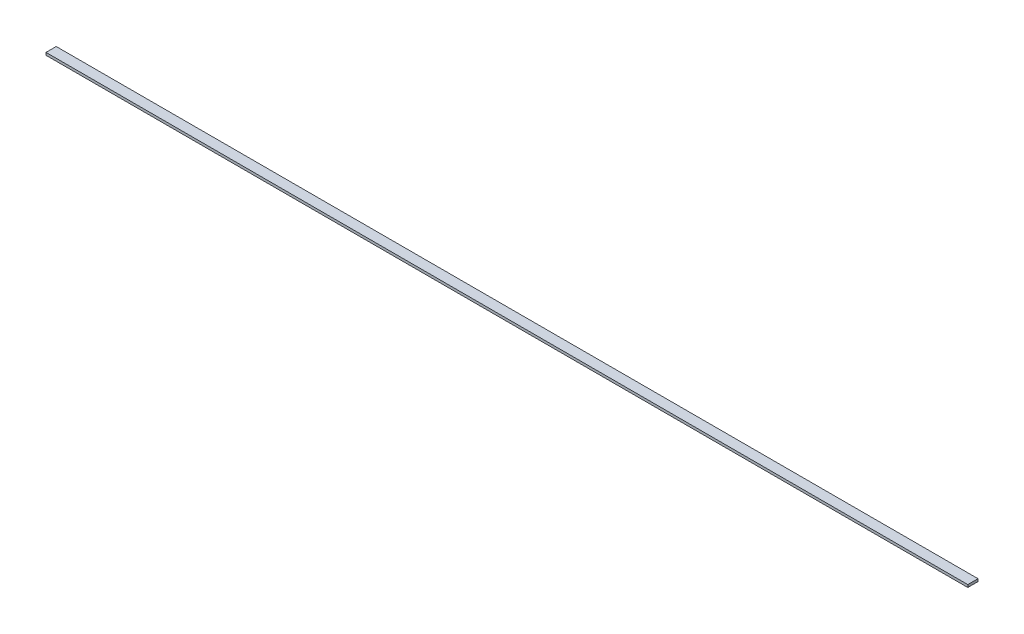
from build123d import *

# Parameters (mm, degrees)
SKETCH1_W           = 2292.35
SKETCH1_H           = 25.4
BOSS_EXTRUDE1_DEPTH = 6.35


with BuildPart() as part:
    # Sketch1 → Boss-Extrude1 (new body)
    with BuildSketch(Plane(origin=(0, 0, 0), x_dir=(1, 0, 0), z_dir=(0, 1, 0))):
        Rectangle(SKETCH1_W, SKETCH1_H)
    extrude(amount=BOSS_EXTRUDE1_DEPTH)


solid = part.part
